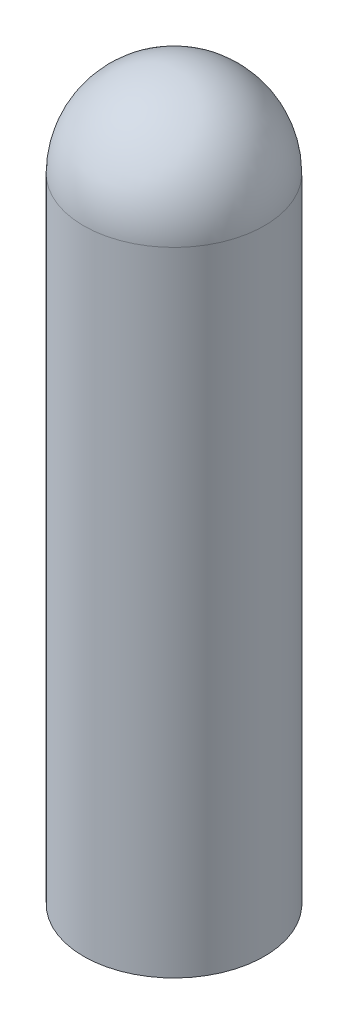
from build123d import *

# Parameters (mm, degrees)
SKETCH1_R                      = 5
BOSS_EXTRUDE1_DEPTH            = 40
FILLET7_R                      = 5
TAP_DRILL_FOR_10_32_TAP1_D     = 4.0386
TAP_DRILL_FOR_10_32_TAP1_DEPTH = 35
TAP_DRILL_FOR_10_32_TAP1_TIP   = 1.213317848


with BuildPart() as part:
    # Sketch1 → Boss-Extrude1 (new body)
    with BuildSketch(Plane(origin=(0, 0, 0), x_dir=(1, 0, 0), z_dir=(0, 1, 0))):
        with Locations(Location((0, 0, 0), (0, 0, 270))):
            Circle(SKETCH1_R)
    extrude(amount=BOSS_EXTRUDE1_DEPTH)

    # Fillet7
    fillet7_edges = [part.edges().sort_by_distance(p)[0] for p in [
        (0, 40, -5),
    ]]
    fillet(fillet7_edges, radius=FILLET7_R)

    # Tap Drill for _10-32 Tap1
    with Locations(Plane(origin=(0, 0, 0), x_dir=(-1, 0, 0), z_dir=(0, -1, 0))):
        with Locations((0, 0)):
            Hole(TAP_DRILL_FOR_10_32_TAP1_D / 2, depth=TAP_DRILL_FOR_10_32_TAP1_DEPTH)
            with Locations((0, 0, -(TAP_DRILL_FOR_10_32_TAP1_DEPTH + TAP_DRILL_FOR_10_32_TAP1_TIP / 2))):  # 118° drill point
                Cone(0, TAP_DRILL_FOR_10_32_TAP1_D / 2, TAP_DRILL_FOR_10_32_TAP1_TIP, mode=Mode.SUBTRACT)


solid = part.part
